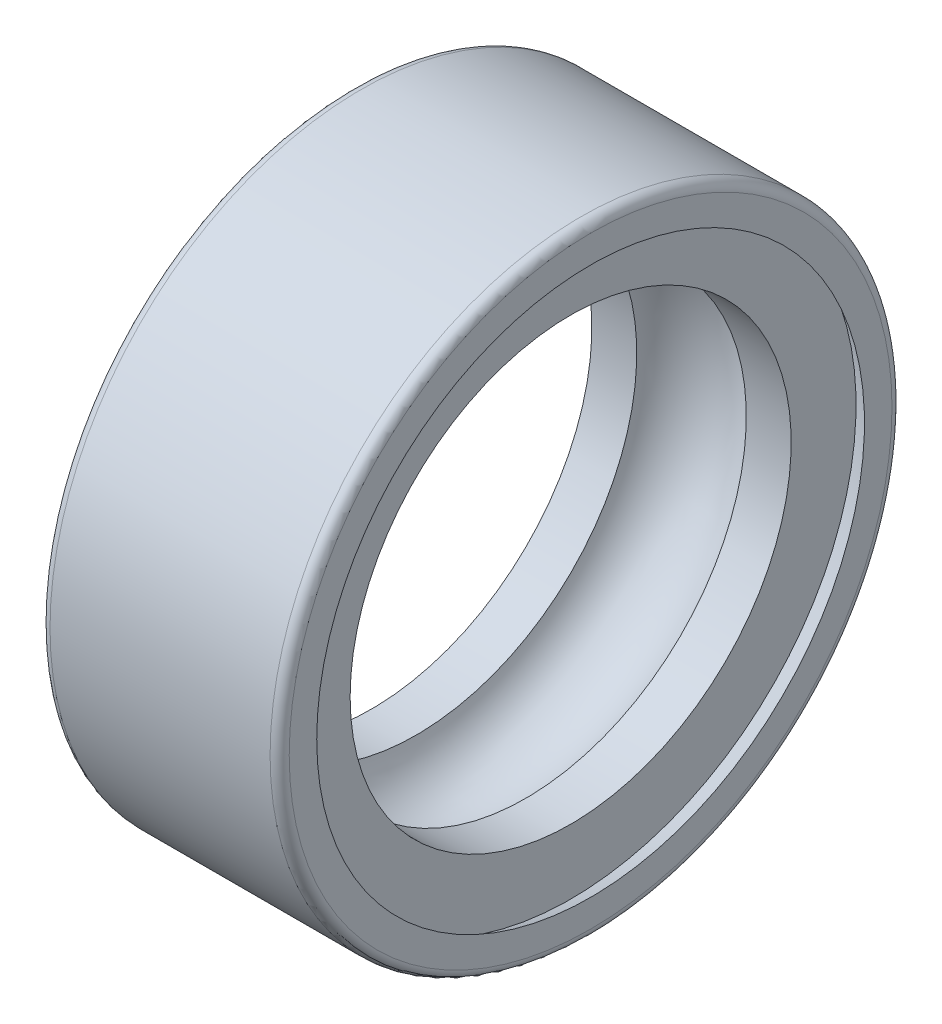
ISO-10303-21;
HEADER;
FILE_DESCRIPTION(('STEP AP214'),'2;1');
FILE_NAME('part.step','',(''),(''),'','','');
FILE_SCHEMA(('AUTOMOTIVE_DESIGN { 1 0 10303 214 1 1 1 1 }'));
ENDSEC;
DATA;
#1=APPLICATION_CONTEXT('core data for automotive mechanical design processes');
#2=APPLICATION_PROTOCOL_DEFINITION('international standard','automotive_design',2000,#1);
#3=PRODUCT_CONTEXT('',#1,'mechanical');
#4=PRODUCT('Part','Part','',(#3));
#5=PRODUCT_RELATED_PRODUCT_CATEGORY('part','',(#4));
#6=PRODUCT_DEFINITION_FORMATION('','',#4);
#7=PRODUCT_DEFINITION_CONTEXT('part definition',#1,'design');
#8=PRODUCT_DEFINITION('design','',#6,#7);
#9=PRODUCT_DEFINITION_SHAPE('','',#8);
#10=(LENGTH_UNIT() NAMED_UNIT(*) SI_UNIT(.MILLI.,.METRE.));
#11=(NAMED_UNIT(*) PLANE_ANGLE_UNIT() SI_UNIT($,.RADIAN.));
#12=(NAMED_UNIT(*) SI_UNIT($,.STERADIAN.) SOLID_ANGLE_UNIT());
#13=UNCERTAINTY_MEASURE_WITH_UNIT(LENGTH_MEASURE(1.E-05),#10,'distance_accuracy_value','');
#14=(GEOMETRIC_REPRESENTATION_CONTEXT(3) GLOBAL_UNCERTAINTY_ASSIGNED_CONTEXT((#13)) GLOBAL_UNIT_ASSIGNED_CONTEXT((#10,
#11,#12)) REPRESENTATION_CONTEXT('',''));
#15=CARTESIAN_POINT('',(0.,0.,0.));
#16=DIRECTION('',(0.,0.,1.));
#17=DIRECTION('',(1.,0.,0.));
#18=AXIS2_PLACEMENT_3D('',#15,#16,#17);
#19=CARTESIAN_POINT('',(0.,0.,0.));
#20=DIRECTION('',(-1.,0.,0.));
#21=DIRECTION('',(0.,0.,1.));
#22=AXIS2_PLACEMENT_3D('',#19,#20,#21);
#23=CYLINDRICAL_SURFACE('',#22,4.61);
#24=CARTESIAN_POINT('',(4.58333333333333,0.,0.));
#25=DIRECTION('',(-1.,0.,0.));
#26=DIRECTION('',(0.,0.,1.));
#27=AXIS2_PLACEMENT_3D('',#24,#25,#26);
#28=CIRCLE('',#27,4.61);
#29=CARTESIAN_POINT('',(4.58333333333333,0.,4.61));
#30=VERTEX_POINT('',#29);
#31=EDGE_CURVE('E10',#30,#30,#28,.T.);
#32=ORIENTED_EDGE('',*,*,#31,.F.);
#33=EDGE_LOOP('',(#32));
#34=FACE_BOUND('',#33,.T.);
#35=CARTESIAN_POINT('',(3.64472704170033,0.,0.));
#36=DIRECTION('',(-1.,0.,0.));
#37=DIRECTION('',(0.,0.,1.));
#38=AXIS2_PLACEMENT_3D('',#35,#36,#37);
#39=CIRCLE('',#38,4.61);
#40=CARTESIAN_POINT('',(3.64472704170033,0.,4.61));
#41=VERTEX_POINT('',#40);
#42=EDGE_CURVE('E73',#41,#41,#39,.T.);
#43=ORIENTED_EDGE('',*,*,#42,.T.);
#44=EDGE_LOOP('',(#43));
#45=FACE_BOUND('',#44,.T.);
#46=ADVANCED_FACE('F15',(#34,#45),#23,.F.);
#47=CARTESIAN_POINT('',(4.58333333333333,4.61,0.));
#48=DIRECTION('',(-1.,0.,0.));
#49=DIRECTION('',(0.,0.,1.));
#50=AXIS2_PLACEMENT_3D('',#47,#48,#49);
#51=PLANE('',#50);
#52=CARTESIAN_POINT('',(4.58333333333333,0.,0.));
#53=DIRECTION('',(-1.,0.,0.));
#54=DIRECTION('',(0.,0.,1.));
#55=AXIS2_PLACEMENT_3D('',#52,#53,#54);
#56=CIRCLE('',#55,5.96556261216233);
#57=CARTESIAN_POINT('',(4.58333333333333,0.,5.96556261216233));
#58=VERTEX_POINT('',#57);
#59=EDGE_CURVE('E22',#58,#58,#56,.T.);
#60=ORIENTED_EDGE('',*,*,#59,.F.);
#61=EDGE_LOOP('',(#60));
#62=FACE_BOUND('',#61,.T.);
#63=ORIENTED_EDGE('',*,*,#31,.T.);
#64=EDGE_LOOP('',(#63));
#65=FACE_BOUND('',#64,.T.);
#66=ADVANCED_FACE('F92',(#62,#65),#51,.F.);
#67=CARTESIAN_POINT('',(4.58333333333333,0.,0.));
#68=DIRECTION('',(-1.,0.,0.));
#69=DIRECTION('',(0.,0.,1.));
#70=AXIS2_PLACEMENT_3D('',#67,#68,#69);
#71=CONICAL_SURFACE('',#70,5.96556261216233,0.523598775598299);
#72=CARTESIAN_POINT('',(5.,0.,0.));
#73=DIRECTION('',(-1.,0.,0.));
#74=DIRECTION('',(0.,0.,1.));
#75=AXIS2_PLACEMENT_3D('',#72,#73,#74);
#76=CIRCLE('',#75,5.725);
#77=CARTESIAN_POINT('',(5.,0.,5.725));
#78=VERTEX_POINT('',#77);
#79=EDGE_CURVE('E31',#78,#78,#76,.T.);
#80=ORIENTED_EDGE('',*,*,#79,.F.);
#81=EDGE_LOOP('',(#80));
#82=FACE_BOUND('',#81,.T.);
#83=ORIENTED_EDGE('',*,*,#59,.T.);
#84=EDGE_LOOP('',(#83));
#85=FACE_BOUND('',#84,.T.);
#86=ADVANCED_FACE('F97',(#82,#85),#71,.F.);
#87=CARTESIAN_POINT('',(5.,5.725,0.));
#88=DIRECTION('',(-1.,0.,0.));
#89=DIRECTION('',(0.,0.,1.));
#90=AXIS2_PLACEMENT_3D('',#87,#88,#89);
#91=PLANE('',#90);
#92=CARTESIAN_POINT('',(5.,0.,0.));
#93=DIRECTION('',(-1.,0.,0.));
#94=DIRECTION('',(0.,0.,1.));
#95=AXIS2_PLACEMENT_3D('',#92,#93,#94);
#96=CIRCLE('',#95,6.3);
#97=CARTESIAN_POINT('',(5.,0.,6.3));
#98=VERTEX_POINT('',#97);
#99=EDGE_CURVE('E39',#98,#98,#96,.T.);
#100=ORIENTED_EDGE('',*,*,#99,.F.);
#101=EDGE_LOOP('',(#100));
#102=FACE_BOUND('',#101,.T.);
#103=ORIENTED_EDGE('',*,*,#79,.T.);
#104=EDGE_LOOP('',(#103));
#105=FACE_BOUND('',#104,.T.);
#106=ADVANCED_FACE('F102',(#102,#105),#91,.F.);
#107=CARTESIAN_POINT('',(4.8,0.,0.));
#108=DIRECTION('',(-1.,0.,0.));
#109=DIRECTION('',(0.,0.,1.));
#110=AXIS2_PLACEMENT_3D('',#107,#108,#109);
#111=TOROIDAL_SURFACE('',#110,6.3,0.2);
#112=CARTESIAN_POINT('',(4.8,0.,0.));
#113=DIRECTION('',(-1.,0.,0.));
#114=DIRECTION('',(0.,0.,1.));
#115=AXIS2_PLACEMENT_3D('',#112,#113,#114);
#116=CIRCLE('',#115,6.5);
#117=CARTESIAN_POINT('',(4.8,0.,6.5));
#118=VERTEX_POINT('',#117);
#119=EDGE_CURVE('E45',#118,#118,#116,.T.);
#120=ORIENTED_EDGE('',*,*,#119,.F.);
#121=EDGE_LOOP('',(#120));
#122=FACE_BOUND('',#121,.T.);
#123=ORIENTED_EDGE('',*,*,#99,.T.);
#124=EDGE_LOOP('',(#123));
#125=FACE_BOUND('',#124,.T.);
#126=ADVANCED_FACE('F108',(#122,#125),#111,.T.);
#127=CARTESIAN_POINT('',(0.,0.,0.));
#128=DIRECTION('',(-1.,0.,0.));
#129=DIRECTION('',(0.,0.,1.));
#130=AXIS2_PLACEMENT_3D('',#127,#128,#129);
#131=CYLINDRICAL_SURFACE('',#130,6.5);
#132=CARTESIAN_POINT('',(0.2,0.,0.));
#133=DIRECTION('',(-1.,0.,0.));
#134=DIRECTION('',(0.,0.,1.));
#135=AXIS2_PLACEMENT_3D('',#132,#133,#134);
#136=CIRCLE('',#135,6.5);
#137=CARTESIAN_POINT('',(0.2,0.,6.5));
#138=VERTEX_POINT('',#137);
#139=EDGE_CURVE('E49',#138,#138,#136,.T.);
#140=ORIENTED_EDGE('',*,*,#139,.F.);
#141=EDGE_LOOP('',(#140));
#142=FACE_BOUND('',#141,.T.);
#143=ORIENTED_EDGE('',*,*,#119,.T.);
#144=EDGE_LOOP('',(#143));
#145=FACE_BOUND('',#144,.T.);
#146=ADVANCED_FACE('F112',(#142,#145),#131,.T.);
#147=CARTESIAN_POINT('',(0.2,0.,0.));
#148=DIRECTION('',(-1.,0.,0.));
#149=DIRECTION('',(0.,0.,1.));
#150=AXIS2_PLACEMENT_3D('',#147,#148,#149);
#151=TOROIDAL_SURFACE('',#150,6.3,0.2);
#152=CARTESIAN_POINT('',(0.,0.,0.));
#153=DIRECTION('',(-1.,0.,0.));
#154=DIRECTION('',(0.,0.,1.));
#155=AXIS2_PLACEMENT_3D('',#152,#153,#154);
#156=CIRCLE('',#155,6.3);
#157=CARTESIAN_POINT('',(0.,0.,6.3));
#158=VERTEX_POINT('',#157);
#159=EDGE_CURVE('E53',#158,#158,#156,.T.);
#160=ORIENTED_EDGE('',*,*,#159,.F.);
#161=EDGE_LOOP('',(#160));
#162=FACE_BOUND('',#161,.T.);
#163=ORIENTED_EDGE('',*,*,#139,.T.);
#164=EDGE_LOOP('',(#163));
#165=FACE_BOUND('',#164,.T.);
#166=ADVANCED_FACE('F116',(#162,#165),#151,.T.);
#167=CARTESIAN_POINT('',(0.,6.3,0.));
#168=DIRECTION('',(1.,0.,0.));
#169=DIRECTION('',(0.,0.,-1.));
#170=AXIS2_PLACEMENT_3D('',#167,#168,#169);
#171=PLANE('',#170);
#172=CARTESIAN_POINT('',(0.,0.,0.));
#173=DIRECTION('',(-1.,0.,0.));
#174=DIRECTION('',(0.,0.,1.));
#175=AXIS2_PLACEMENT_3D('',#172,#173,#174);
#176=CIRCLE('',#175,5.725);
#177=CARTESIAN_POINT('',(0.,0.,5.725));
#178=VERTEX_POINT('',#177);
#179=EDGE_CURVE('E57',#178,#178,#176,.T.);
#180=ORIENTED_EDGE('',*,*,#179,.F.);
#181=EDGE_LOOP('',(#180));
#182=FACE_BOUND('',#181,.T.);
#183=ORIENTED_EDGE('',*,*,#159,.T.);
#184=EDGE_LOOP('',(#183));
#185=FACE_BOUND('',#184,.T.);
#186=ADVANCED_FACE('F120',(#182,#185),#171,.F.);
#187=CARTESIAN_POINT('',(0.,0.,0.));
#188=DIRECTION('',(1.,0.,0.));
#189=DIRECTION('',(0.,0.,-1.));
#190=AXIS2_PLACEMENT_3D('',#187,#188,#189);
#191=CONICAL_SURFACE('',#190,5.725,0.523598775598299);
#192=CARTESIAN_POINT('',(0.416666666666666,0.,0.));
#193=DIRECTION('',(-1.,0.,0.));
#194=DIRECTION('',(0.,0.,1.));
#195=AXIS2_PLACEMENT_3D('',#192,#193,#194);
#196=CIRCLE('',#195,5.96556261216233);
#197=CARTESIAN_POINT('',(0.416666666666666,0.,5.96556261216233));
#198=VERTEX_POINT('',#197);
#199=EDGE_CURVE('E61',#198,#198,#196,.T.);
#200=ORIENTED_EDGE('',*,*,#199,.F.);
#201=EDGE_LOOP('',(#200));
#202=FACE_BOUND('',#201,.T.);
#203=ORIENTED_EDGE('',*,*,#179,.T.);
#204=EDGE_LOOP('',(#203));
#205=FACE_BOUND('',#204,.T.);
#206=ADVANCED_FACE('F124',(#202,#205),#191,.F.);
#207=CARTESIAN_POINT('',(0.416666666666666,5.96556261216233,0.));
#208=DIRECTION('',(1.,0.,0.));
#209=DIRECTION('',(0.,0.,-1.));
#210=AXIS2_PLACEMENT_3D('',#207,#208,#209);
#211=PLANE('',#210);
#212=CARTESIAN_POINT('',(0.416666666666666,0.,0.));
#213=DIRECTION('',(-1.,0.,0.));
#214=DIRECTION('',(0.,0.,1.));
#215=AXIS2_PLACEMENT_3D('',#212,#213,#214);
#216=CIRCLE('',#215,4.61);
#217=CARTESIAN_POINT('',(0.416666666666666,0.,4.61));
#218=VERTEX_POINT('',#217);
#219=EDGE_CURVE('E65',#218,#218,#216,.T.);
#220=ORIENTED_EDGE('',*,*,#219,.F.);
#221=EDGE_LOOP('',(#220));
#222=FACE_BOUND('',#221,.T.);
#223=ORIENTED_EDGE('',*,*,#199,.T.);
#224=EDGE_LOOP('',(#223));
#225=FACE_BOUND('',#224,.T.);
#226=ADVANCED_FACE('F88',(#222,#225),#211,.F.);
#227=CARTESIAN_POINT('',(0.,0.,0.));
#228=DIRECTION('',(-1.,0.,0.));
#229=DIRECTION('',(0.,0.,1.));
#230=AXIS2_PLACEMENT_3D('',#227,#228,#229);
#231=CYLINDRICAL_SURFACE('',#230,4.61);
#232=CARTESIAN_POINT('',(1.35527295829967,0.,0.));
#233=DIRECTION('',(-1.,0.,0.));
#234=DIRECTION('',(0.,0.,1.));
#235=AXIS2_PLACEMENT_3D('',#232,#233,#234);
#236=CIRCLE('',#235,4.61);
#237=CARTESIAN_POINT('',(1.35527295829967,0.,4.61));
#238=VERTEX_POINT('',#237);
#239=EDGE_CURVE('E69',#238,#238,#236,.T.);
#240=ORIENTED_EDGE('',*,*,#239,.F.);
#241=EDGE_LOOP('',(#240));
#242=FACE_BOUND('',#241,.T.);
#243=ORIENTED_EDGE('',*,*,#219,.T.);
#244=EDGE_LOOP('',(#243));
#245=FACE_BOUND('',#244,.T.);
#246=ADVANCED_FACE('F81',(#242,#245),#231,.F.);
#247=CARTESIAN_POINT('',(2.5,0.,0.));
#248=DIRECTION('',(-1.,0.,0.));
#249=DIRECTION('',(0.,0.,1.));
#250=AXIS2_PLACEMENT_3D('',#247,#248,#249);
#251=TOROIDAL_SURFACE('',#250,4.25,1.2);
#252=ORIENTED_EDGE('',*,*,#239,.T.);
#253=EDGE_LOOP('',(#252));
#254=FACE_BOUND('',#253,.T.);
#255=ORIENTED_EDGE('',*,*,#42,.F.);
#256=EDGE_LOOP('',(#255));
#257=FACE_BOUND('',#256,.T.);
#258=ADVANCED_FACE('F79',(#254,#257),#251,.F.);
#259=CLOSED_SHELL('',(#46,#66,#86,#106,#126,#146,#166,#186,#206,#226,#246,#258));
#260=MANIFOLD_SOLID_BREP('B1',#259);
#261=ADVANCED_BREP_SHAPE_REPRESENTATION('',(#18,#260),#14);
#262=SHAPE_DEFINITION_REPRESENTATION(#9,#261);
ENDSEC;
END-ISO-10303-21;
